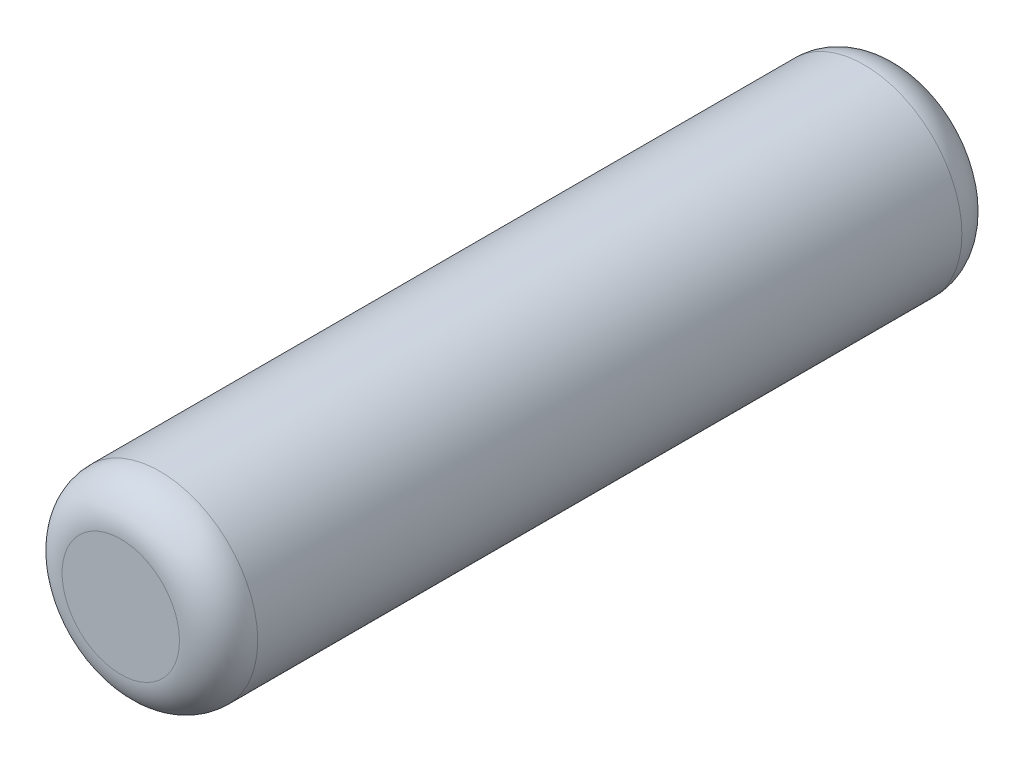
from build123d import *

# Parameters (mm, degrees)
ESQUISSE1_R          = 2.5
BASE_EXTRUSION_DEPTH = 20
CONG_1_R             = 1


with BuildPart() as part:
    # Esquisse1 → Base-Extrusion (new body)
    with BuildSketch(Plane.XY):
        Circle(ESQUISSE1_R)
    extrude(amount=BASE_EXTRUSION_DEPTH)

    # Cong_1
    cong_1_edges = [part.edges().sort_by_distance(p)[0] for p in [
        (-2.5, 0, 0),
        (-2.5, 0, 20),
    ]]
    fillet(cong_1_edges, radius=CONG_1_R)


solid = part.part
